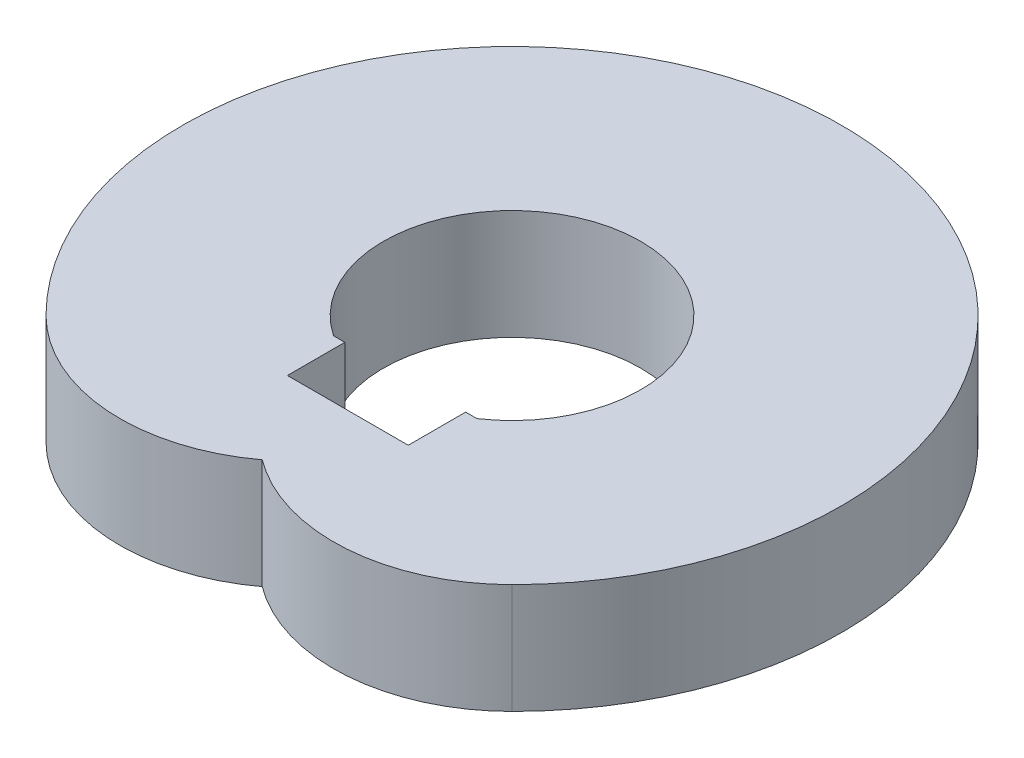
ISO-10303-21;
HEADER;
FILE_DESCRIPTION(('STEP AP214'),'2;1');
FILE_NAME('part.step','',(''),(''),'','','');
FILE_SCHEMA(('AUTOMOTIVE_DESIGN { 1 0 10303 214 1 1 1 1 }'));
ENDSEC;
DATA;
#1=APPLICATION_CONTEXT('core data for automotive mechanical design processes');
#2=APPLICATION_PROTOCOL_DEFINITION('international standard','automotive_design',2000,#1);
#3=PRODUCT_CONTEXT('',#1,'mechanical');
#4=PRODUCT('Part','Part','',(#3));
#5=PRODUCT_RELATED_PRODUCT_CATEGORY('part','',(#4));
#6=PRODUCT_DEFINITION_FORMATION('','',#4);
#7=PRODUCT_DEFINITION_CONTEXT('part definition',#1,'design');
#8=PRODUCT_DEFINITION('design','',#6,#7);
#9=PRODUCT_DEFINITION_SHAPE('','',#8);
#10=(LENGTH_UNIT() NAMED_UNIT(*) SI_UNIT(.MILLI.,.METRE.));
#11=(NAMED_UNIT(*) PLANE_ANGLE_UNIT() SI_UNIT($,.RADIAN.));
#12=(NAMED_UNIT(*) SI_UNIT($,.STERADIAN.) SOLID_ANGLE_UNIT());
#13=UNCERTAINTY_MEASURE_WITH_UNIT(LENGTH_MEASURE(1.E-05),#10,'distance_accuracy_value','');
#14=(GEOMETRIC_REPRESENTATION_CONTEXT(3) GLOBAL_UNCERTAINTY_ASSIGNED_CONTEXT((#13)) GLOBAL_UNIT_ASSIGNED_CONTEXT((#10,
#11,#12)) REPRESENTATION_CONTEXT('',''));
#15=CARTESIAN_POINT('',(0.,0.,0.));
#16=DIRECTION('',(0.,0.,1.));
#17=DIRECTION('',(1.,0.,0.));
#18=AXIS2_PLACEMENT_3D('',#15,#16,#17);
#19=CARTESIAN_POINT('',(97.2271824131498,200.,97.2271824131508));
#20=DIRECTION('',(0.,1.,0.));
#21=DIRECTION('',(0.,0.,1.));
#22=AXIS2_PLACEMENT_3D('',#19,#20,#21);
#23=PLANE('',#22);
#24=CARTESIAN_POINT('',(194.4543648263,200.,194.454364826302));
#25=DIRECTION('',(0.,1.,0.));
#26=DIRECTION('',(0.,0.,1.));
#27=AXIS2_PLACEMENT_3D('',#24,#25,#26);
#28=CIRCLE('',#27,324.999999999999);
#29=CARTESIAN_POINT('',(1.27675647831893E-12,200.,454.862698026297));
#30=VERTEX_POINT('',#29);
#31=CARTESIAN_POINT('',(424.264068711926,200.,424.264068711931));
#32=VERTEX_POINT('',#31);
#33=EDGE_CURVE('E157',#30,#32,#28,.T.);
#34=ORIENTED_EDGE('',*,*,#33,.T.);
#35=CARTESIAN_POINT('',(0.,200.,0.));
#36=DIRECTION('',(0.,1.,0.));
#37=DIRECTION('',(0.,0.,1.));
#38=AXIS2_PLACEMENT_3D('',#35,#36,#37);
#39=CIRCLE('',#38,600.);
#40=CARTESIAN_POINT('',(-424.264068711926,200.,424.264068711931));
#41=VERTEX_POINT('',#40);
#42=EDGE_CURVE('E160',#32,#41,#39,.T.);
#43=ORIENTED_EDGE('',*,*,#42,.T.);
#44=CARTESIAN_POINT('',(-194.454364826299,200.,194.454364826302));
#45=DIRECTION('',(0.,1.,0.));
#46=DIRECTION('',(0.,0.,1.));
#47=AXIS2_PLACEMENT_3D('',#44,#45,#46);
#48=CIRCLE('',#47,325.);
#49=EDGE_CURVE('E163',#41,#30,#48,.T.);
#50=ORIENTED_EDGE('',*,*,#49,.T.);
#51=EDGE_LOOP('',(#34,#43,#50));
#52=FACE_BOUND('',#51,.T.);
#53=DIRECTION('',(0.,0.,1.));
#54=VECTOR('',#53,1.);
#55=CARTESIAN_POINT('',(-110.,200.,194.454364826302));
#56=LINE('',#55,#54);
#57=CARTESIAN_POINT('',(-110.,200.,194.454364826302));
#58=VERTEX_POINT('',#57);
#59=CARTESIAN_POINT('',(-110.,200.,299.));
#60=VERTEX_POINT('',#59);
#61=EDGE_CURVE('E114',#58,#60,#56,.T.);
#62=ORIENTED_EDGE('',*,*,#61,.F.);
#63=DIRECTION('',(1.,0.,0.));
#64=VECTOR('',#63,1.);
#65=CARTESIAN_POINT('',(-110.,200.,194.454364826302));
#66=LINE('',#65,#64);
#67=CARTESIAN_POINT('',(-130.545635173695,200.,194.454364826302));
#68=VERTEX_POINT('',#67);
#69=EDGE_CURVE('E106',#68,#58,#66,.T.);
#70=ORIENTED_EDGE('',*,*,#69,.F.);
#71=CARTESIAN_POINT('',(0.,200.,0.));
#72=DIRECTION('',(0.,1.,0.));
#73=DIRECTION('',(0.,0.,1.));
#74=AXIS2_PLACEMENT_3D('',#71,#72,#73);
#75=CIRCLE('',#74,234.210723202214);
#76=CARTESIAN_POINT('',(130.545635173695,200.,194.454364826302));
#77=VERTEX_POINT('',#76);
#78=EDGE_CURVE('E135',#77,#68,#75,.T.);
#79=ORIENTED_EDGE('',*,*,#78,.F.);
#80=DIRECTION('',(1.,0.,0.));
#81=VECTOR('',#80,1.);
#82=CARTESIAN_POINT('',(130.545635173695,200.,194.454364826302));
#83=LINE('',#82,#81);
#84=CARTESIAN_POINT('',(110.,200.,194.454364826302));
#85=VERTEX_POINT('',#84);
#86=EDGE_CURVE('E133',#85,#77,#83,.T.);
#87=ORIENTED_EDGE('',*,*,#86,.F.);
#88=DIRECTION('',(0.,0.,-1.));
#89=VECTOR('',#88,1.);
#90=CARTESIAN_POINT('',(110.,200.,194.454364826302));
#91=LINE('',#90,#89);
#92=CARTESIAN_POINT('',(110.,200.,299.));
#93=VERTEX_POINT('',#92);
#94=EDGE_CURVE('E129',#93,#85,#91,.T.);
#95=ORIENTED_EDGE('',*,*,#94,.F.);
#96=DIRECTION('',(1.,0.,0.));
#97=VECTOR('',#96,1.);
#98=CARTESIAN_POINT('',(-110.,200.,299.));
#99=LINE('',#98,#97);
#100=EDGE_CURVE('E127',#60,#93,#99,.T.);
#101=ORIENTED_EDGE('',*,*,#100,.F.);
#102=EDGE_LOOP('',(#62,#70,#79,#87,#95,#101));
#103=FACE_BOUND('',#102,.T.);
#104=ADVANCED_FACE('F35',(#52,#103),#23,.T.);
#105=CARTESIAN_POINT('',(97.2271824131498,0.,97.2271824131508));
#106=DIRECTION('',(0.,1.,0.));
#107=DIRECTION('',(0.,0.,1.));
#108=AXIS2_PLACEMENT_3D('',#105,#106,#107);
#109=PLANE('',#108);
#110=CARTESIAN_POINT('',(194.4543648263,0.,194.454364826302));
#111=DIRECTION('',(0.,1.,0.));
#112=DIRECTION('',(0.,0.,1.));
#113=AXIS2_PLACEMENT_3D('',#110,#111,#112);
#114=CIRCLE('',#113,324.999999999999);
#115=CARTESIAN_POINT('',(1.27675647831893E-12,0.,454.862698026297));
#116=VERTEX_POINT('',#115);
#117=CARTESIAN_POINT('',(424.264068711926,0.,424.264068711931));
#118=VERTEX_POINT('',#117);
#119=EDGE_CURVE('E122',#116,#118,#114,.T.);
#120=ORIENTED_EDGE('',*,*,#119,.F.);
#121=CARTESIAN_POINT('',(-194.454364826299,0.,194.454364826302));
#122=DIRECTION('',(0.,1.,0.));
#123=DIRECTION('',(0.,0.,1.));
#124=AXIS2_PLACEMENT_3D('',#121,#122,#123);
#125=CIRCLE('',#124,325.);
#126=CARTESIAN_POINT('',(-424.264068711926,0.,424.264068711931));
#127=VERTEX_POINT('',#126);
#128=EDGE_CURVE('E161',#127,#116,#125,.T.);
#129=ORIENTED_EDGE('',*,*,#128,.F.);
#130=CARTESIAN_POINT('',(0.,0.,0.));
#131=DIRECTION('',(0.,1.,0.));
#132=DIRECTION('',(0.,0.,1.));
#133=AXIS2_PLACEMENT_3D('',#130,#131,#132);
#134=CIRCLE('',#133,600.);
#135=EDGE_CURVE('E168',#118,#127,#134,.T.);
#136=ORIENTED_EDGE('',*,*,#135,.F.);
#137=EDGE_LOOP('',(#120,#129,#136));
#138=FACE_BOUND('',#137,.T.);
#139=DIRECTION('',(1.,0.,0.));
#140=VECTOR('',#139,1.);
#141=CARTESIAN_POINT('',(-110.,0.,194.454364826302));
#142=LINE('',#141,#140);
#143=CARTESIAN_POINT('',(-130.545635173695,0.,194.454364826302));
#144=VERTEX_POINT('',#143);
#145=CARTESIAN_POINT('',(-110.,0.,194.454364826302));
#146=VERTEX_POINT('',#145);
#147=EDGE_CURVE('E58',#144,#146,#142,.T.);
#148=ORIENTED_EDGE('',*,*,#147,.T.);
#149=DIRECTION('',(0.,0.,1.));
#150=VECTOR('',#149,1.);
#151=CARTESIAN_POINT('',(-110.,0.,194.454364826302));
#152=LINE('',#151,#150);
#153=CARTESIAN_POINT('',(-110.,0.,299.));
#154=VERTEX_POINT('',#153);
#155=EDGE_CURVE('E121',#146,#154,#152,.T.);
#156=ORIENTED_EDGE('',*,*,#155,.T.);
#157=DIRECTION('',(1.,0.,0.));
#158=VECTOR('',#157,1.);
#159=CARTESIAN_POINT('',(-110.,0.,299.));
#160=LINE('',#159,#158);
#161=CARTESIAN_POINT('',(110.,0.,299.));
#162=VERTEX_POINT('',#161);
#163=EDGE_CURVE('E139',#154,#162,#160,.T.);
#164=ORIENTED_EDGE('',*,*,#163,.T.);
#165=DIRECTION('',(0.,0.,-1.));
#166=VECTOR('',#165,1.);
#167=CARTESIAN_POINT('',(110.,0.,194.454364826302));
#168=LINE('',#167,#166);
#169=CARTESIAN_POINT('',(110.,0.,194.454364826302));
#170=VERTEX_POINT('',#169);
#171=EDGE_CURVE('E142',#162,#170,#168,.T.);
#172=ORIENTED_EDGE('',*,*,#171,.T.);
#173=DIRECTION('',(1.,0.,0.));
#174=VECTOR('',#173,1.);
#175=CARTESIAN_POINT('',(130.545635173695,0.,194.454364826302));
#176=LINE('',#175,#174);
#177=CARTESIAN_POINT('',(130.545635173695,0.,194.454364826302));
#178=VERTEX_POINT('',#177);
#179=EDGE_CURVE('E145',#170,#178,#176,.T.);
#180=ORIENTED_EDGE('',*,*,#179,.T.);
#181=CARTESIAN_POINT('',(0.,0.,0.));
#182=DIRECTION('',(0.,1.,0.));
#183=DIRECTION('',(0.,0.,1.));
#184=AXIS2_PLACEMENT_3D('',#181,#182,#183);
#185=CIRCLE('',#184,234.210723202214);
#186=EDGE_CURVE('E115',#178,#144,#185,.T.);
#187=ORIENTED_EDGE('',*,*,#186,.T.);
#188=EDGE_LOOP('',(#148,#156,#164,#172,#180,#187));
#189=FACE_BOUND('',#188,.T.);
#190=ADVANCED_FACE('F182',(#138,#189),#109,.F.);
#191=CARTESIAN_POINT('',(194.4543648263,200.,194.454364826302));
#192=DIRECTION('',(0.,-1.,0.));
#193=DIRECTION('',(0.,0.,-1.));
#194=AXIS2_PLACEMENT_3D('',#191,#192,#193);
#195=CYLINDRICAL_SURFACE('',#194,324.999999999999);
#196=ORIENTED_EDGE('',*,*,#119,.T.);
#197=DIRECTION('',(0.,-1.,0.));
#198=VECTOR('',#197,1.);
#199=CARTESIAN_POINT('',(424.264068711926,200.,424.264068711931));
#200=LINE('',#199,#198);
#201=EDGE_CURVE('E11',#32,#118,#200,.T.);
#202=ORIENTED_EDGE('',*,*,#201,.F.);
#203=ORIENTED_EDGE('',*,*,#33,.F.);
#204=DIRECTION('',(0.,-1.,0.));
#205=VECTOR('',#204,1.);
#206=CARTESIAN_POINT('',(1.27675647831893E-12,200.,454.862698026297));
#207=LINE('',#206,#205);
#208=EDGE_CURVE('E165',#30,#116,#207,.T.);
#209=ORIENTED_EDGE('',*,*,#208,.T.);
#210=EDGE_LOOP('',(#196,#202,#203,#209));
#211=FACE_BOUND('',#210,.T.);
#212=ADVANCED_FACE('F37',(#211),#195,.T.);
#213=CARTESIAN_POINT('',(0.,200.,0.));
#214=DIRECTION('',(0.,-1.,0.));
#215=DIRECTION('',(0.,0.,-1.));
#216=AXIS2_PLACEMENT_3D('',#213,#214,#215);
#217=CYLINDRICAL_SURFACE('',#216,600.);
#218=ORIENTED_EDGE('',*,*,#135,.T.);
#219=DIRECTION('',(0.,-1.,0.));
#220=VECTOR('',#219,1.);
#221=CARTESIAN_POINT('',(-424.264068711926,200.,424.264068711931));
#222=LINE('',#221,#220);
#223=EDGE_CURVE('E43',#41,#127,#222,.T.);
#224=ORIENTED_EDGE('',*,*,#223,.F.);
#225=ORIENTED_EDGE('',*,*,#42,.F.);
#226=ORIENTED_EDGE('',*,*,#201,.T.);
#227=EDGE_LOOP('',(#218,#224,#225,#226));
#228=FACE_BOUND('',#227,.T.);
#229=ADVANCED_FACE('F188',(#228),#217,.T.);
#230=CARTESIAN_POINT('',(-194.454364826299,200.,194.454364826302));
#231=DIRECTION('',(0.,-1.,0.));
#232=DIRECTION('',(0.,0.,-1.));
#233=AXIS2_PLACEMENT_3D('',#230,#231,#232);
#234=CYLINDRICAL_SURFACE('',#233,325.);
#235=ORIENTED_EDGE('',*,*,#128,.T.);
#236=ORIENTED_EDGE('',*,*,#208,.F.);
#237=ORIENTED_EDGE('',*,*,#49,.F.);
#238=ORIENTED_EDGE('',*,*,#223,.T.);
#239=EDGE_LOOP('',(#235,#236,#237,#238));
#240=FACE_BOUND('',#239,.T.);
#241=ADVANCED_FACE('F177',(#240),#234,.T.);
#242=CARTESIAN_POINT('',(-110.,200.,194.454364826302));
#243=DIRECTION('',(0.,0.,-1.));
#244=DIRECTION('',(-1.,0.,0.));
#245=AXIS2_PLACEMENT_3D('',#242,#243,#244);
#246=PLANE('',#245);
#247=ORIENTED_EDGE('',*,*,#147,.F.);
#248=DIRECTION('',(0.,-1.,0.));
#249=VECTOR('',#248,1.);
#250=CARTESIAN_POINT('',(-130.545635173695,200.,194.454364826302));
#251=LINE('',#250,#249);
#252=EDGE_CURVE('E110',#68,#144,#251,.T.);
#253=ORIENTED_EDGE('',*,*,#252,.F.);
#254=ORIENTED_EDGE('',*,*,#69,.T.);
#255=DIRECTION('',(0.,-1.,0.));
#256=VECTOR('',#255,1.);
#257=CARTESIAN_POINT('',(-110.,200.,194.454364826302));
#258=LINE('',#257,#256);
#259=EDGE_CURVE('E109',#58,#146,#258,.T.);
#260=ORIENTED_EDGE('',*,*,#259,.T.);
#261=EDGE_LOOP('',(#247,#253,#254,#260));
#262=FACE_BOUND('',#261,.T.);
#263=ADVANCED_FACE('F108',(#262),#246,.T.);
#264=CARTESIAN_POINT('',(-110.,200.,194.454364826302));
#265=DIRECTION('',(1.,0.,0.));
#266=DIRECTION('',(0.,0.,-1.));
#267=AXIS2_PLACEMENT_3D('',#264,#265,#266);
#268=PLANE('',#267);
#269=ORIENTED_EDGE('',*,*,#155,.F.);
#270=ORIENTED_EDGE('',*,*,#259,.F.);
#271=ORIENTED_EDGE('',*,*,#61,.T.);
#272=DIRECTION('',(0.,-1.,0.));
#273=VECTOR('',#272,1.);
#274=CARTESIAN_POINT('',(-110.,200.,299.));
#275=LINE('',#274,#273);
#276=EDGE_CURVE('E123',#60,#154,#275,.T.);
#277=ORIENTED_EDGE('',*,*,#276,.T.);
#278=EDGE_LOOP('',(#269,#270,#271,#277));
#279=FACE_BOUND('',#278,.T.);
#280=ADVANCED_FACE('F118',(#279),#268,.T.);
#281=CARTESIAN_POINT('',(-110.,200.,299.));
#282=DIRECTION('',(0.,0.,-1.));
#283=DIRECTION('',(-1.,0.,0.));
#284=AXIS2_PLACEMENT_3D('',#281,#282,#283);
#285=PLANE('',#284);
#286=ORIENTED_EDGE('',*,*,#163,.F.);
#287=ORIENTED_EDGE('',*,*,#276,.F.);
#288=ORIENTED_EDGE('',*,*,#100,.T.);
#289=DIRECTION('',(0.,-1.,0.));
#290=VECTOR('',#289,1.);
#291=CARTESIAN_POINT('',(110.,200.,299.));
#292=LINE('',#291,#290);
#293=EDGE_CURVE('E154',#93,#162,#292,.T.);
#294=ORIENTED_EDGE('',*,*,#293,.T.);
#295=EDGE_LOOP('',(#286,#287,#288,#294));
#296=FACE_BOUND('',#295,.T.);
#297=ADVANCED_FACE('F206',(#296),#285,.T.);
#298=CARTESIAN_POINT('',(110.,200.,194.454364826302));
#299=DIRECTION('',(-1.,0.,0.));
#300=DIRECTION('',(0.,0.,1.));
#301=AXIS2_PLACEMENT_3D('',#298,#299,#300);
#302=PLANE('',#301);
#303=ORIENTED_EDGE('',*,*,#171,.F.);
#304=ORIENTED_EDGE('',*,*,#293,.F.);
#305=ORIENTED_EDGE('',*,*,#94,.T.);
#306=DIRECTION('',(0.,-1.,0.));
#307=VECTOR('',#306,1.);
#308=CARTESIAN_POINT('',(110.,200.,194.454364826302));
#309=LINE('',#308,#307);
#310=EDGE_CURVE('E152',#85,#170,#309,.T.);
#311=ORIENTED_EDGE('',*,*,#310,.T.);
#312=EDGE_LOOP('',(#303,#304,#305,#311));
#313=FACE_BOUND('',#312,.T.);
#314=ADVANCED_FACE('F209',(#313),#302,.T.);
#315=CARTESIAN_POINT('',(130.545635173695,200.,194.454364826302));
#316=DIRECTION('',(0.,0.,-1.));
#317=DIRECTION('',(-1.,0.,0.));
#318=AXIS2_PLACEMENT_3D('',#315,#316,#317);
#319=PLANE('',#318);
#320=ORIENTED_EDGE('',*,*,#179,.F.);
#321=ORIENTED_EDGE('',*,*,#310,.F.);
#322=ORIENTED_EDGE('',*,*,#86,.T.);
#323=DIRECTION('',(0.,-1.,0.));
#324=VECTOR('',#323,1.);
#325=CARTESIAN_POINT('',(130.545635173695,200.,194.454364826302));
#326=LINE('',#325,#324);
#327=EDGE_CURVE('E50',#77,#178,#326,.T.);
#328=ORIENTED_EDGE('',*,*,#327,.T.);
#329=EDGE_LOOP('',(#320,#321,#322,#328));
#330=FACE_BOUND('',#329,.T.);
#331=ADVANCED_FACE('F213',(#330),#319,.T.);
#332=CARTESIAN_POINT('',(0.,200.,0.));
#333=DIRECTION('',(0.,-1.,0.));
#334=DIRECTION('',(0.,0.,-1.));
#335=AXIS2_PLACEMENT_3D('',#332,#333,#334);
#336=CYLINDRICAL_SURFACE('',#335,234.210723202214);
#337=ORIENTED_EDGE('',*,*,#186,.F.);
#338=ORIENTED_EDGE('',*,*,#327,.F.);
#339=ORIENTED_EDGE('',*,*,#78,.T.);
#340=ORIENTED_EDGE('',*,*,#252,.T.);
#341=EDGE_LOOP('',(#337,#338,#339,#340));
#342=FACE_BOUND('',#341,.T.);
#343=ADVANCED_FACE('F217',(#342),#336,.F.);
#344=CLOSED_SHELL('',(#104,#190,#212,#229,#241,#263,#280,#297,#314,#331,#343));
#345=MANIFOLD_SOLID_BREP('B2',#344);
#346=ADVANCED_BREP_SHAPE_REPRESENTATION('',(#18,#345),#14);
#347=SHAPE_DEFINITION_REPRESENTATION(#9,#346);
ENDSEC;
END-ISO-10303-21;
